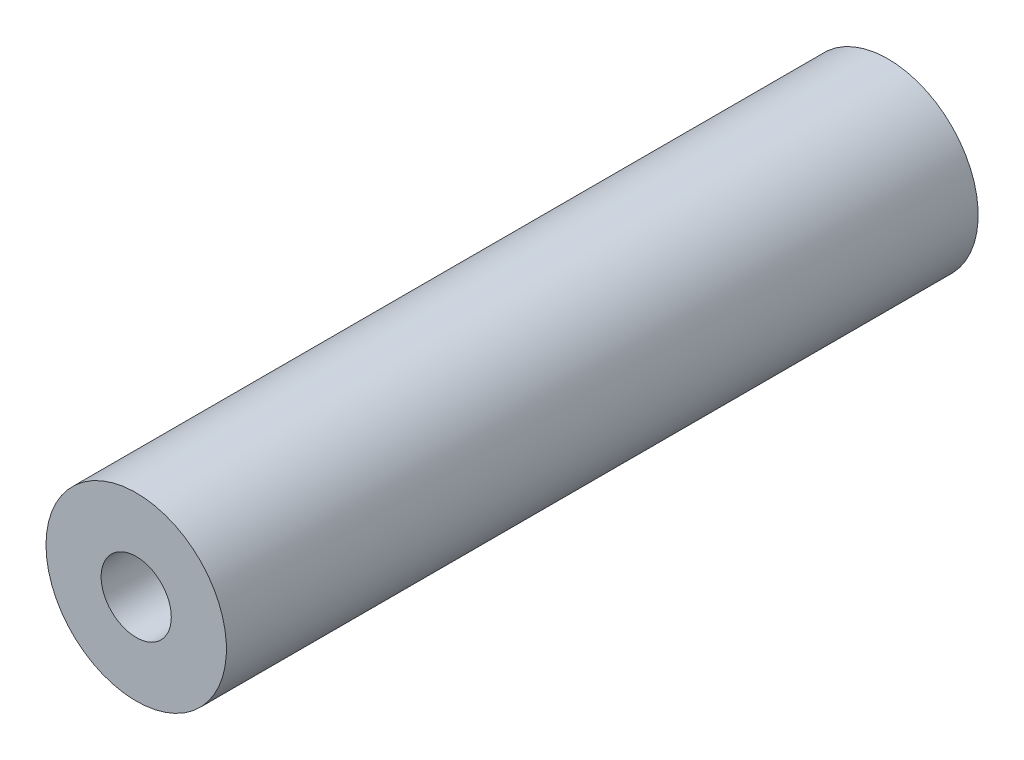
ISO-10303-21;
HEADER;
FILE_DESCRIPTION(('STEP AP214'),'2;1');
FILE_NAME('part.step','',(''),(''),'','','');
FILE_SCHEMA(('AUTOMOTIVE_DESIGN { 1 0 10303 214 1 1 1 1 }'));
ENDSEC;
DATA;
#1=APPLICATION_CONTEXT('core data for automotive mechanical design processes');
#2=APPLICATION_PROTOCOL_DEFINITION('international standard','automotive_design',2000,#1);
#3=PRODUCT_CONTEXT('',#1,'mechanical');
#4=PRODUCT('Part','Part','',(#3));
#5=PRODUCT_RELATED_PRODUCT_CATEGORY('part','',(#4));
#6=PRODUCT_DEFINITION_FORMATION('','',#4);
#7=PRODUCT_DEFINITION_CONTEXT('part definition',#1,'design');
#8=PRODUCT_DEFINITION('design','',#6,#7);
#9=PRODUCT_DEFINITION_SHAPE('','',#8);
#10=(LENGTH_UNIT() NAMED_UNIT(*) SI_UNIT(.MILLI.,.METRE.));
#11=(NAMED_UNIT(*) PLANE_ANGLE_UNIT() SI_UNIT($,.RADIAN.));
#12=(NAMED_UNIT(*) SI_UNIT($,.STERADIAN.) SOLID_ANGLE_UNIT());
#13=UNCERTAINTY_MEASURE_WITH_UNIT(LENGTH_MEASURE(1.E-05),#10,'distance_accuracy_value','');
#14=(GEOMETRIC_REPRESENTATION_CONTEXT(3) GLOBAL_UNCERTAINTY_ASSIGNED_CONTEXT((#13)) GLOBAL_UNIT_ASSIGNED_CONTEXT((#10,
#11,#12)) REPRESENTATION_CONTEXT('',''));
#15=CARTESIAN_POINT('',(0.,0.,0.));
#16=DIRECTION('',(0.,0.,1.));
#17=DIRECTION('',(1.,0.,0.));
#18=AXIS2_PLACEMENT_3D('',#15,#16,#17);
#19=CARTESIAN_POINT('',(0.,0.,45.));
#20=DIRECTION('',(0.,0.,-1.));
#21=DIRECTION('',(-1.,0.,0.));
#22=AXIS2_PLACEMENT_3D('',#19,#20,#21);
#23=CYLINDRICAL_SURFACE('',#22,5.4);
#24=CARTESIAN_POINT('',(0.,0.,45.));
#25=DIRECTION('',(0.,0.,1.));
#26=DIRECTION('',(1.,0.,0.));
#27=AXIS2_PLACEMENT_3D('',#24,#25,#26);
#28=CIRCLE('',#27,5.4);
#29=CARTESIAN_POINT('',(-5.4,0.,45.));
#30=VERTEX_POINT('',#29);
#31=EDGE_CURVE('E11',#30,#30,#28,.T.);
#32=CARTESIAN_POINT('',(0.,0.,0.));
#33=DIRECTION('',(0.,0.,1.));
#34=DIRECTION('',(1.,0.,0.));
#35=AXIS2_PLACEMENT_3D('',#32,#33,#34);
#36=CIRCLE('',#35,5.4);
#37=CARTESIAN_POINT('',(-5.4,0.,0.));
#38=VERTEX_POINT('',#37);
#39=EDGE_CURVE('E48',#38,#38,#36,.T.);
#40=CARTESIAN_POINT('',(-5.4,0.,45.));
#41=CARTESIAN_POINT('',(-5.4,0.,44.53125));
#42=CARTESIAN_POINT('',(-5.4,0.,44.0625));
#43=CARTESIAN_POINT('',(-5.4,0.,43.125));
#44=CARTESIAN_POINT('',(-5.4,0.,42.65625));
#45=CARTESIAN_POINT('',(-5.4,0.,41.71875));
#46=CARTESIAN_POINT('',(-5.4,0.,41.25));
#47=CARTESIAN_POINT('',(-5.4,0.,40.3125));
#48=CARTESIAN_POINT('',(-5.4,0.,39.84375));
#49=CARTESIAN_POINT('',(-5.4,0.,38.90625));
#50=CARTESIAN_POINT('',(-5.4,0.,38.4375));
#51=CARTESIAN_POINT('',(-5.4,0.,37.5));
#52=CARTESIAN_POINT('',(-5.4,0.,37.03125));
#53=CARTESIAN_POINT('',(-5.4,0.,36.09375));
#54=CARTESIAN_POINT('',(-5.4,0.,35.625));
#55=CARTESIAN_POINT('',(-5.4,0.,34.6875));
#56=CARTESIAN_POINT('',(-5.4,0.,34.21875));
#57=CARTESIAN_POINT('',(-5.4,0.,33.28125));
#58=CARTESIAN_POINT('',(-5.4,0.,32.8125));
#59=CARTESIAN_POINT('',(-5.4,0.,31.875));
#60=CARTESIAN_POINT('',(-5.4,0.,31.40625));
#61=CARTESIAN_POINT('',(-5.4,0.,30.46875));
#62=CARTESIAN_POINT('',(-5.4,0.,30.));
#63=CARTESIAN_POINT('',(-5.4,0.,29.0625));
#64=CARTESIAN_POINT('',(-5.4,0.,28.59375));
#65=CARTESIAN_POINT('',(-5.4,0.,27.65625));
#66=CARTESIAN_POINT('',(-5.4,0.,27.1875));
#67=CARTESIAN_POINT('',(-5.4,0.,26.25));
#68=CARTESIAN_POINT('',(-5.4,0.,25.78125));
#69=CARTESIAN_POINT('',(-5.4,0.,24.84375));
#70=CARTESIAN_POINT('',(-5.4,0.,24.375));
#71=CARTESIAN_POINT('',(-5.4,0.,23.4375));
#72=CARTESIAN_POINT('',(-5.4,0.,22.96875));
#73=CARTESIAN_POINT('',(-5.4,0.,22.03125));
#74=CARTESIAN_POINT('',(-5.4,0.,21.5625));
#75=CARTESIAN_POINT('',(-5.4,0.,20.625));
#76=CARTESIAN_POINT('',(-5.4,0.,20.15625));
#77=CARTESIAN_POINT('',(-5.4,0.,19.21875));
#78=CARTESIAN_POINT('',(-5.4,0.,18.75));
#79=CARTESIAN_POINT('',(-5.4,0.,17.8125));
#80=CARTESIAN_POINT('',(-5.4,0.,17.34375));
#81=CARTESIAN_POINT('',(-5.4,0.,16.40625));
#82=CARTESIAN_POINT('',(-5.4,0.,15.9375));
#83=CARTESIAN_POINT('',(-5.4,0.,15.));
#84=CARTESIAN_POINT('',(-5.4,0.,14.53125));
#85=CARTESIAN_POINT('',(-5.4,0.,13.59375));
#86=CARTESIAN_POINT('',(-5.4,0.,13.125));
#87=CARTESIAN_POINT('',(-5.4,0.,12.1875));
#88=CARTESIAN_POINT('',(-5.4,0.,11.71875));
#89=CARTESIAN_POINT('',(-5.4,0.,10.78125));
#90=CARTESIAN_POINT('',(-5.4,0.,10.3125));
#91=CARTESIAN_POINT('',(-5.4,0.,9.37499999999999));
#92=CARTESIAN_POINT('',(-5.4,0.,8.90624999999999));
#93=CARTESIAN_POINT('',(-5.4,0.,7.96874999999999));
#94=CARTESIAN_POINT('',(-5.4,0.,7.5));
#95=CARTESIAN_POINT('',(-5.4,0.,6.56249999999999));
#96=CARTESIAN_POINT('',(-5.4,0.,6.09374999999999));
#97=CARTESIAN_POINT('',(-5.4,0.,5.15624999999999));
#98=CARTESIAN_POINT('',(-5.4,0.,4.68749999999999));
#99=CARTESIAN_POINT('',(-5.4,0.,3.74999999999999));
#100=CARTESIAN_POINT('',(-5.4,0.,3.28124999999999));
#101=CARTESIAN_POINT('',(-5.4,0.,2.34374999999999));
#102=CARTESIAN_POINT('',(-5.4,0.,1.87499999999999));
#103=CARTESIAN_POINT('',(-5.4,0.,0.937499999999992));
#104=CARTESIAN_POINT('',(-5.4,0.,0.468749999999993));
#105=CARTESIAN_POINT('',(-5.4,0.,0.));
#106=B_SPLINE_CURVE_WITH_KNOTS('',3,(#40,#41,#42,#43,#44,#45,#46,#47,#48,#49,#50,#51,#52,#53,
#54,#55,#56,#57,#58,#59,#60,#61,#62,#63,#64,#65,#66,#67,#68,#69,#70,#71,#72,#73,#74,#75,#76,#77,
#78,#79,#80,#81,#82,#83,#84,#85,#86,#87,#88,#89,#90,#91,#92,#93,#94,#95,#96,#97,#98,#99,#100,
#101,#102,#103,#104,#105),.UNSPECIFIED.,.F.,.F.,(4,2,2,2,2,2,2,2,2,2,2,2,2,2,2,2,2,2,2,2,2,2,2,
2,2,2,2,2,2,2,2,2,4),(0.,1.40625,2.8125,4.21874999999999,5.625,7.03125,8.43749999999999,9.84375,
11.25,12.65625,14.0625,15.46875,16.875,18.28125,19.6875,21.09375,22.5,23.90625,25.3125,26.71875,
28.125,29.53125,30.9375,32.34375,33.75,35.15625,36.5625,37.96875,39.375,40.78125,42.1875,
43.59375,45.),.UNSPECIFIED.);
#107=EDGE_CURVE('BSEAM45',#30,#38,#106,.T.);
#108=ORIENTED_EDGE('',*,*,#31,.F.);
#109=ORIENTED_EDGE('',*,*,#39,.T.);
#110=ORIENTED_EDGE('',*,*,#107,.T.);
#111=ORIENTED_EDGE('',*,*,#107,.F.);
#112=EDGE_LOOP('',(#108,#110,#109,#111));
#113=FACE_BOUND('',#112,.T.);
#114=ADVANCED_FACE('F45',(#113),#23,.T.);
#115=CARTESIAN_POINT('',(0.,0.,45.));
#116=DIRECTION('',(0.,0.,1.));
#117=DIRECTION('',(1.,0.,0.));
#118=AXIS2_PLACEMENT_3D('',#115,#116,#117);
#119=PLANE('',#118);
#120=CARTESIAN_POINT('',(0.,0.,45.));
#121=DIRECTION('',(0.,0.,1.));
#122=DIRECTION('',(1.,0.,0.));
#123=AXIS2_PLACEMENT_3D('',#120,#121,#122);
#124=CIRCLE('',#123,2.09999999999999);
#125=CARTESIAN_POINT('',(2.09999999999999,0.,45.));
#126=VERTEX_POINT('',#125);
#127=EDGE_CURVE('E99',#126,#126,#124,.T.);
#128=ORIENTED_EDGE('',*,*,#127,.F.);
#129=EDGE_LOOP('',(#128));
#130=FACE_BOUND('',#129,.T.);
#131=ORIENTED_EDGE('',*,*,#31,.T.);
#132=EDGE_LOOP('',(#131));
#133=FACE_BOUND('',#132,.T.);
#134=ADVANCED_FACE('F116',(#130,#133),#119,.T.);
#135=CARTESIAN_POINT('',(0.,0.,0.));
#136=DIRECTION('',(0.,0.,1.));
#137=DIRECTION('',(1.,0.,0.));
#138=AXIS2_PLACEMENT_3D('',#135,#136,#137);
#139=PLANE('',#138);
#140=CARTESIAN_POINT('',(2.59807621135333,-1.49999999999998,0.));
#141=DIRECTION('',(0.,0.,-1.));
#142=DIRECTION('',(-1.,0.,0.));
#143=AXIS2_PLACEMENT_3D('',#140,#141,#142);
#144=CIRCLE('',#143,0.79999999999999);
#145=CARTESIAN_POINT('',(1.79807621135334,-1.49999999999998,0.));
#146=VERTEX_POINT('',#145);
#147=EDGE_CURVE('E78',#146,#146,#144,.T.);
#148=ORIENTED_EDGE('',*,*,#147,.F.);
#149=EDGE_LOOP('',(#148));
#150=FACE_BOUND('',#149,.T.);
#151=CARTESIAN_POINT('',(-2.59807621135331,-1.50000000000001,0.));
#152=DIRECTION('',(0.,0.,-1.));
#153=DIRECTION('',(-1.,0.,0.));
#154=AXIS2_PLACEMENT_3D('',#151,#152,#153);
#155=CIRCLE('',#154,0.79999999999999);
#156=CARTESIAN_POINT('',(-3.3980762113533,-1.50000000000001,0.));
#157=VERTEX_POINT('',#156);
#158=EDGE_CURVE('E77',#157,#157,#155,.T.);
#159=ORIENTED_EDGE('',*,*,#158,.F.);
#160=EDGE_LOOP('',(#159));
#161=FACE_BOUND('',#160,.T.);
#162=CARTESIAN_POINT('',(0.,3.,0.));
#163=DIRECTION('',(0.,0.,-1.));
#164=DIRECTION('',(-1.,0.,0.));
#165=AXIS2_PLACEMENT_3D('',#162,#163,#164);
#166=CIRCLE('',#165,0.79999999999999);
#167=CARTESIAN_POINT('',(-0.79999999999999,3.,0.));
#168=VERTEX_POINT('',#167);
#169=EDGE_CURVE('E91',#168,#168,#166,.T.);
#170=ORIENTED_EDGE('',*,*,#169,.F.);
#171=EDGE_LOOP('',(#170));
#172=FACE_BOUND('',#171,.T.);
#173=ORIENTED_EDGE('',*,*,#39,.F.);
#174=EDGE_LOOP('',(#173));
#175=FACE_BOUND('',#174,.T.);
#176=ADVANCED_FACE('F113',(#150,#161,#172,#175),#139,.F.);
#177=CARTESIAN_POINT('',(0.,0.,31.));
#178=DIRECTION('',(0.,0.,1.));
#179=DIRECTION('',(1.,0.,0.));
#180=AXIS2_PLACEMENT_3D('',#177,#178,#179);
#181=CONICAL_SURFACE('',#180,2.09999999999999,1.02974425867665);
#182=CARTESIAN_POINT('',(0.,0.,29.7381927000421));
#183=VERTEX_POINT('',#182);
#184=VERTEX_LOOP('',#183);
#185=FACE_BOUND('',#184,.T.);
#186=CARTESIAN_POINT('',(0.,0.,31.));
#187=DIRECTION('',(0.,0.,1.));
#188=DIRECTION('',(1.,0.,0.));
#189=AXIS2_PLACEMENT_3D('',#186,#187,#188);
#190=CIRCLE('',#189,2.09999999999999);
#191=CARTESIAN_POINT('',(2.09999999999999,0.,31.));
#192=VERTEX_POINT('',#191);
#193=EDGE_CURVE('E103',#192,#192,#190,.T.);
#194=ORIENTED_EDGE('',*,*,#193,.T.);
#195=EDGE_LOOP('',(#194));
#196=FACE_BOUND('',#195,.T.);
#197=ADVANCED_FACE('F115',(#185,#196),#181,.F.);
#198=CARTESIAN_POINT('',(0.,0.,45.));
#199=DIRECTION('',(0.,0.,1.));
#200=DIRECTION('',(1.,0.,0.));
#201=AXIS2_PLACEMENT_3D('',#198,#199,#200);
#202=CYLINDRICAL_SURFACE('',#201,2.09999999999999);
#203=ORIENTED_EDGE('',*,*,#193,.F.);
#204=EDGE_LOOP('',(#203));
#205=FACE_BOUND('',#204,.T.);
#206=ORIENTED_EDGE('',*,*,#127,.T.);
#207=EDGE_LOOP('',(#206));
#208=FACE_BOUND('',#207,.T.);
#209=ADVANCED_FACE('F122',(#205,#208),#202,.F.);
#210=CARTESIAN_POINT('',(0.,3.,8.));
#211=DIRECTION('',(0.,0.,-1.));
#212=DIRECTION('',(-1.,0.,0.));
#213=AXIS2_PLACEMENT_3D('',#210,#211,#212);
#214=CONICAL_SURFACE('',#213,0.799999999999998,1.02974425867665);
#215=CARTESIAN_POINT('',(0.,3.,8.48068849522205));
#216=VERTEX_POINT('',#215);
#217=VERTEX_LOOP('',#216);
#218=FACE_BOUND('',#217,.T.);
#219=CARTESIAN_POINT('',(0.,3.,8.));
#220=DIRECTION('',(0.,0.,-1.));
#221=DIRECTION('',(-1.,0.,0.));
#222=AXIS2_PLACEMENT_3D('',#219,#220,#221);
#223=CIRCLE('',#222,0.799999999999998);
#224=CARTESIAN_POINT('',(-0.799999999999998,3.,8.));
#225=VERTEX_POINT('',#224);
#226=EDGE_CURVE('E95',#225,#225,#223,.T.);
#227=ORIENTED_EDGE('',*,*,#226,.T.);
#228=EDGE_LOOP('',(#227));
#229=FACE_BOUND('',#228,.T.);
#230=ADVANCED_FACE('F150',(#218,#229),#214,.F.);
#231=CARTESIAN_POINT('',(0.,3.,0.));
#232=DIRECTION('',(0.,0.,-1.));
#233=DIRECTION('',(-1.,0.,0.));
#234=AXIS2_PLACEMENT_3D('',#231,#232,#233);
#235=CYLINDRICAL_SURFACE('',#234,0.799999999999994);
#236=ORIENTED_EDGE('',*,*,#226,.F.);
#237=EDGE_LOOP('',(#236));
#238=FACE_BOUND('',#237,.T.);
#239=ORIENTED_EDGE('',*,*,#169,.T.);
#240=EDGE_LOOP('',(#239));
#241=FACE_BOUND('',#240,.T.);
#242=ADVANCED_FACE('F155',(#238,#241),#235,.F.);
#243=CARTESIAN_POINT('',(-2.59807621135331,-1.50000000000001,8.));
#244=DIRECTION('',(0.,0.,-1.));
#245=DIRECTION('',(-1.,0.,0.));
#246=AXIS2_PLACEMENT_3D('',#243,#244,#245);
#247=CONICAL_SURFACE('',#246,0.799999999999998,1.02974425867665);
#248=CARTESIAN_POINT('',(-2.59807621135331,-1.50000000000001,8.48068849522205));
#249=VERTEX_POINT('',#248);
#250=VERTEX_LOOP('',#249);
#251=FACE_BOUND('',#250,.T.);
#252=CARTESIAN_POINT('',(-2.59807621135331,-1.50000000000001,8.));
#253=DIRECTION('',(0.,0.,-1.));
#254=DIRECTION('',(-1.,0.,0.));
#255=AXIS2_PLACEMENT_3D('',#252,#253,#254);
#256=CIRCLE('',#255,0.799999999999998);
#257=CARTESIAN_POINT('',(-3.39807621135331,-1.50000000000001,8.));
#258=VERTEX_POINT('',#257);
#259=EDGE_CURVE('E83',#258,#258,#256,.T.);
#260=ORIENTED_EDGE('',*,*,#259,.T.);
#261=EDGE_LOOP('',(#260));
#262=FACE_BOUND('',#261,.T.);
#263=ADVANCED_FACE('F161',(#251,#262),#247,.F.);
#264=CARTESIAN_POINT('',(-2.59807621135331,-1.50000000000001,0.));
#265=DIRECTION('',(0.,0.,-1.));
#266=DIRECTION('',(-1.,0.,0.));
#267=AXIS2_PLACEMENT_3D('',#264,#265,#266);
#268=CYLINDRICAL_SURFACE('',#267,0.799999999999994);
#269=ORIENTED_EDGE('',*,*,#259,.F.);
#270=EDGE_LOOP('',(#269));
#271=FACE_BOUND('',#270,.T.);
#272=ORIENTED_EDGE('',*,*,#158,.T.);
#273=EDGE_LOOP('',(#272));
#274=FACE_BOUND('',#273,.T.);
#275=ADVANCED_FACE('F70',(#271,#274),#268,.F.);
#276=CARTESIAN_POINT('',(2.59807621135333,-1.49999999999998,8.));
#277=DIRECTION('',(0.,0.,-1.));
#278=DIRECTION('',(-1.,0.,0.));
#279=AXIS2_PLACEMENT_3D('',#276,#277,#278);
#280=CONICAL_SURFACE('',#279,0.799999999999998,1.02974425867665);
#281=CARTESIAN_POINT('',(2.59807621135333,-1.49999999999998,8.48068849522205));
#282=VERTEX_POINT('',#281);
#283=VERTEX_LOOP('',#282);
#284=FACE_BOUND('',#283,.T.);
#285=CARTESIAN_POINT('',(2.59807621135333,-1.49999999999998,8.));
#286=DIRECTION('',(0.,0.,-1.));
#287=DIRECTION('',(-1.,0.,0.));
#288=AXIS2_PLACEMENT_3D('',#285,#286,#287);
#289=CIRCLE('',#288,0.799999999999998);
#290=CARTESIAN_POINT('',(1.79807621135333,-1.49999999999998,8.));
#291=VERTEX_POINT('',#290);
#292=EDGE_CURVE('E74',#291,#291,#289,.T.);
#293=ORIENTED_EDGE('',*,*,#292,.T.);
#294=EDGE_LOOP('',(#293));
#295=FACE_BOUND('',#294,.T.);
#296=ADVANCED_FACE('F66',(#284,#295),#280,.F.);
#297=CARTESIAN_POINT('',(2.59807621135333,-1.49999999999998,0.));
#298=DIRECTION('',(0.,0.,-1.));
#299=DIRECTION('',(-1.,0.,0.));
#300=AXIS2_PLACEMENT_3D('',#297,#298,#299);
#301=CYLINDRICAL_SURFACE('',#300,0.799999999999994);
#302=ORIENTED_EDGE('',*,*,#292,.F.);
#303=EDGE_LOOP('',(#302));
#304=FACE_BOUND('',#303,.T.);
#305=ORIENTED_EDGE('',*,*,#147,.T.);
#306=EDGE_LOOP('',(#305));
#307=FACE_BOUND('',#306,.T.);
#308=ADVANCED_FACE('F69',(#304,#307),#301,.F.);
#309=CLOSED_SHELL('',(#114,#134,#176,#197,#209,#230,#242,#263,#275,#296,#308));
#310=MANIFOLD_SOLID_BREP('B2',#309);
#311=ADVANCED_BREP_SHAPE_REPRESENTATION('',(#18,#310),#14);
#312=SHAPE_DEFINITION_REPRESENTATION(#9,#311);
ENDSEC;
END-ISO-10303-21;
